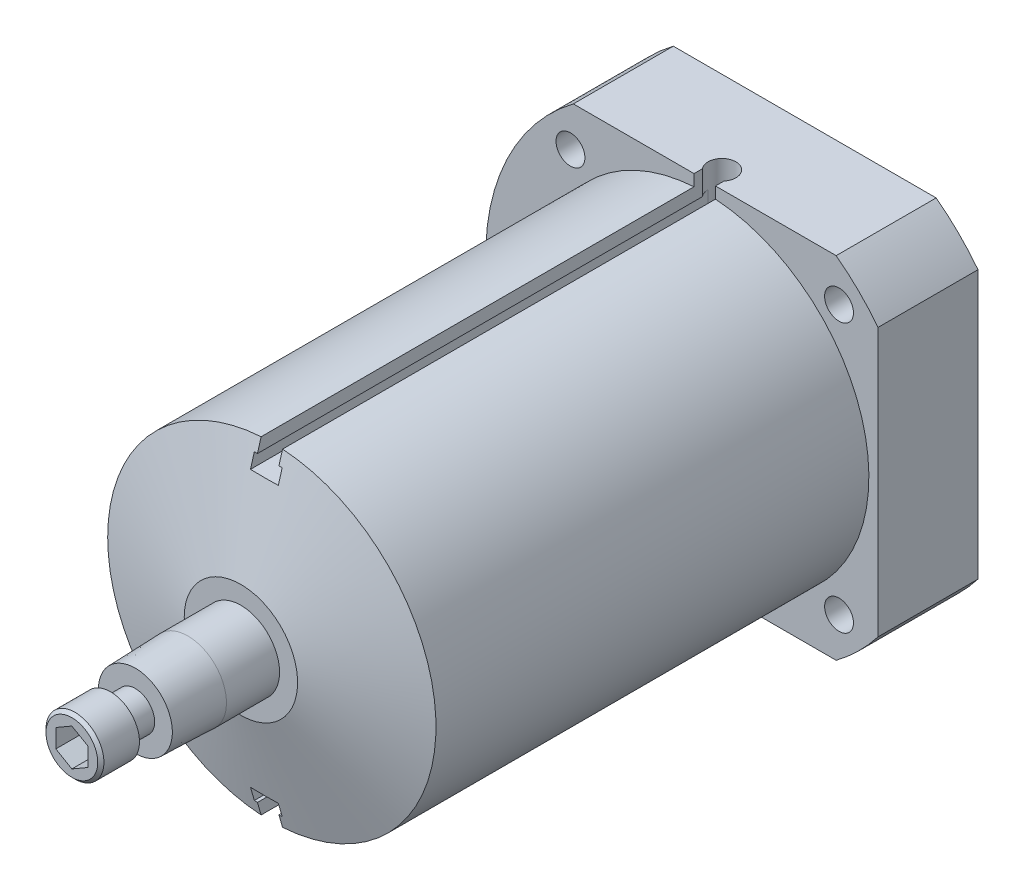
from build123d import *

# Parameters (mm, degrees)
EXTRUDE1_DEPTH     = 138.938
HOLE1_D            = 8.4328
HOLE1_DEPTH        = 19.05
HOLE1_TIP          = 2.533468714
HOLE2_D            = 7.112
CIRPATTERN1_COUNT  = 4
CUT_EXTRUDE1_DEPTH = 118.5418
CUT_EXTRUDE2_DEPTH = 98.425
CUT_EXTRUDE3_REACH = 195.856
SKETCH14_R         = 3.429
CUT_EXTRUDE4_REACH = 195.856
SKETCH15_R         = 3.429
CUT_EXTRUDE5_DEPTH = 6.35


with BuildPart() as part:
    # Sketch1 → Extrude1 (new body)
    with BuildSketch(Plane.XY):
        with BuildLine():
            Line((-32.385, 43.18), (32.385, 43.18))
            ThreePointArc((32.385, 43.18), (37.883437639, 38.446661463), (42.6974, 33.018671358))
            Line((42.6974, 33.018671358), (42.6974, -33.018671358))
            ThreePointArc((42.6974, -33.018671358), (37.883437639, -38.446661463), (32.385, -43.18))
            Line((32.385, -43.18), (-32.385, -43.18))
            ThreePointArc((-32.385, -43.18), (-53.975, 0), (-32.385, 43.18))
        make_face()
    extrude(amount=EXTRUDE1_DEPTH)

    # Sketch2 → Cut-Revolve1 (revolve, cut)
    with BuildSketch(Plane(origin=(0, 0, 0), x_dir=(1, 0, 0), z_dir=(0, 1, 0))):
        Polygon((-53.975, -24.638), (-40.4495, -24.638), (-40.4495, -131.318), (-13.97, -138.938), (-53.975, -138.938), align=None)
    revolve(axis=Axis((0, 0, 0), (0, 0, 1)), mode=Mode.SUBTRACT)

    # Sketch4 → Revolve1 (revolve)
    with BuildSketch(Plane(origin=(0, 0, 0), x_dir=(1, 0, 0), z_dir=(0, 1, 0))):
        Polygon((-9.51865, -138.938), (-9.51865, -152.019), (-9.11225, -164.950857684), (0, -164.950857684), (0, -138.938), align=None)
    revolve(axis=Axis((0, 0, 0), (0, 0, 1)))

    # Hole1
    with Locations(Plane.XY.offset(164.950857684)):
        with Locations((0, 0)):
            Hole(HOLE1_D / 2, depth=HOLE1_DEPTH)
            with Locations((0, 0, -(HOLE1_DEPTH + HOLE1_TIP / 2))):  # 118° drill point
                Cone(0, HOLE1_D / 2, HOLE1_TIP, mode=Mode.SUBTRACT)

    # Hole2 (through all)
    with Locations(Plane.XY.offset(24.638)):
        with Locations((33.092243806, 33.092243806)):
            hole2 = Hole(HOLE2_D / 2)

    # CirPattern1: Hole2 ×4 about axis
    cirpattern1_axis = Axis((0, 0, 0), (0, 0, 1))
    for i in range(1, CIRPATTERN1_COUNT):
        add(hole2.rotate(cirpattern1_axis, i * 360 / CIRPATTERN1_COUNT), mode=Mode.SUBTRACT)

    # Sketch11 → Cut-Revolve2 (revolve, cut)
    with BuildSketch(Plane(origin=(0, 0, 15.7988), x_dir=(-1, 0, 0), z_dir=(0, 0, -1))):
        Polygon((82.83884175, 43.22461736), (36.798406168, 21.755609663), (38.558864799, 17.980293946), (84.599300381, 39.449301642), align=None)
    cut_revolve2 = revolve(axis=Axis((0, 0, 15.7988), (-0.9063077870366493, 0.4226182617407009, 0)), mode=Mode.SUBTRACT)

    # Mirror1: Cut-Revolve2 across plane
    add(cut_revolve2.mirror(Plane.ZX), mode=Mode.SUBTRACT)

    # Sketch12 → Cut-Extrude1 (cut)
    with BuildSketch(Plane.XY.offset(138.938)):
        Polygon((-2.6416, 50.8), (-2.6416, 37.2237), (-3.429, 37.2237), (-3.429, 33.9217), (3.429, 33.9217), (3.429, 37.2237), (2.6416, 37.2237), (2.6416, 50.8), align=None)
    extrude(amount=-CUT_EXTRUDE1_DEPTH, mode=Mode.SUBTRACT)

    # Sketch13 → Cut-Extrude2 (cut)
    with BuildSketch(Plane.XY.offset(138.938)):
        Polygon((-3.429, -33.9217), (3.429, -33.9217), (3.429, -37.2237), (2.6416, -37.2237), (2.6416, -50.8), (-2.6416, -50.8), (-2.6416, -37.2237), (-3.429, -37.2237), align=None)
    extrude(amount=-CUT_EXTRUDE2_DEPTH, mode=Mode.SUBTRACT)

    # Cut-Extrude3: up to this face of the body (flat: up to its plane)
    cut_extrude3_end = Plane(part.part.faces().sort_by_distance((0, 33.9217, 76.788053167))[0])
    # Sketch14 → Cut-Extrude3 (cut, up to the picked face)
    with BuildSketch(Plane(origin=(0, 43.18, 0), x_dir=(1, 0, 0), z_dir=(0, 1, 0)), mode=Mode.PRIVATE) as cut_extrude3_sk1:
        with Locations((0, -20.3962)):
            Circle(SKETCH14_R)
    cut_extrude3_tool1 = split(extrude(cut_extrude3_sk1.sketch, amount=-CUT_EXTRUDE3_REACH, mode=Mode.PRIVATE), bisect_by=cut_extrude3_end, keep=Keep.BOTH, mode=Mode.PRIVATE)
    add(cut_extrude3_tool1.solids().sort_by(Axis((0, 43.18, 20.3962), (0, -1, 0)))[0], mode=Mode.SUBTRACT)

    # Cut-Extrude4: up to this face of the body (flat: up to its plane)
    cut_extrude4_end = Plane(part.part.faces().sort_by_distance((0, -33.9217, 86.846453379))[0])
    # Sketch15 → Cut-Extrude4 (cut, up to the picked face)
    with BuildSketch(Plane.XZ.offset(43.18), mode=Mode.PRIVATE) as cut_extrude4_sk1:
        with Locations((0, 40.513)):
            Circle(SKETCH15_R)
    cut_extrude4_tool1 = split(extrude(cut_extrude4_sk1.sketch, amount=-CUT_EXTRUDE4_REACH, mode=Mode.PRIVATE), bisect_by=cut_extrude4_end, keep=Keep.BOTH, mode=Mode.PRIVATE)
    add(cut_extrude4_tool1.solids().sort_by(Axis((0, -43.18, 40.513), (0, 1, 0)))[0], mode=Mode.SUBTRACT)

    # Sketch16 → Revolve2 (revolve)
    with BuildSketch(Plane(origin=(0, 0, 0), x_dir=(1, 0, 0), z_dir=(0, 1, 0))):
        Polygon((-4.7625, -164.950857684), (-4.7625, -171.069), (-7.1374, -171.069), (-7.1374, -179.832), (-6.3754, -180.594), (0, -180.594), (0, -164.950857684), align=None)
    revolve(axis=Axis((0, 0, 0), (0, 0, 1)))

    # Sketch17 → Cut-Extrude5 (cut)
    with BuildSketch(Plane.XY.offset(180.594)):
        Polygon((3.9624, -2.287692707), (3.9624, 2.287692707), (0, 4.575385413), (-3.9624, 2.287692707), (-3.9624, -2.287692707), (0, -4.575385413), align=None)
    extrude(amount=-CUT_EXTRUDE5_DEPTH, mode=Mode.SUBTRACT)


solid = part.part
